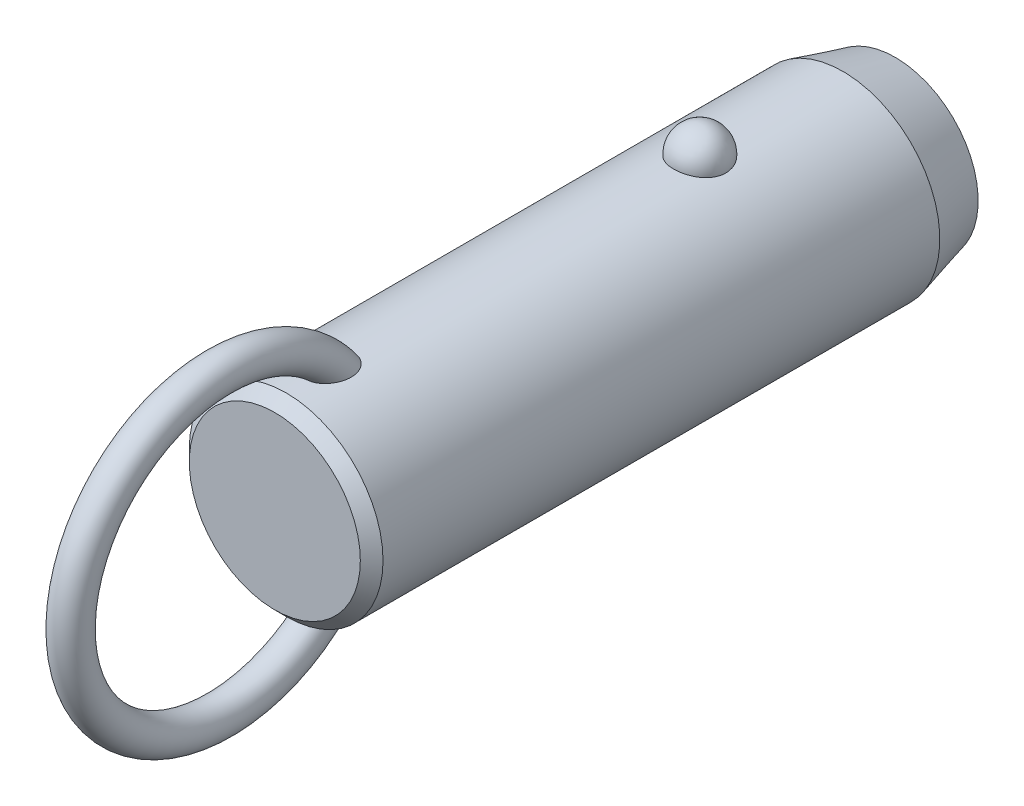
ISO-10303-21;
HEADER;
FILE_DESCRIPTION(('STEP AP214'),'2;1');
FILE_NAME('part.step','',(''),(''),'','','');
FILE_SCHEMA(('AUTOMOTIVE_DESIGN { 1 0 10303 214 1 1 1 1 }'));
ENDSEC;
DATA;
#1=APPLICATION_CONTEXT('core data for automotive mechanical design processes');
#2=APPLICATION_PROTOCOL_DEFINITION('international standard','automotive_design',2000,#1);
#3=PRODUCT_CONTEXT('',#1,'mechanical');
#4=PRODUCT('Part','Part','',(#3));
#5=PRODUCT_RELATED_PRODUCT_CATEGORY('part','',(#4));
#6=PRODUCT_DEFINITION_FORMATION('','',#4);
#7=PRODUCT_DEFINITION_CONTEXT('part definition',#1,'design');
#8=PRODUCT_DEFINITION('design','',#6,#7);
#9=PRODUCT_DEFINITION_SHAPE('','',#8);
#10=(LENGTH_UNIT() NAMED_UNIT(*) SI_UNIT(.MILLI.,.METRE.));
#11=(NAMED_UNIT(*) PLANE_ANGLE_UNIT() SI_UNIT($,.RADIAN.));
#12=(NAMED_UNIT(*) SI_UNIT($,.STERADIAN.) SOLID_ANGLE_UNIT());
#13=UNCERTAINTY_MEASURE_WITH_UNIT(LENGTH_MEASURE(1.E-05),#10,'distance_accuracy_value','');
#14=(GEOMETRIC_REPRESENTATION_CONTEXT(3) GLOBAL_UNCERTAINTY_ASSIGNED_CONTEXT((#13)) GLOBAL_UNIT_ASSIGNED_CONTEXT((#10,
#11,#12)) REPRESENTATION_CONTEXT('',''));
#15=CARTESIAN_POINT('',(0.,0.,0.));
#16=DIRECTION('',(0.,0.,1.));
#17=DIRECTION('',(1.,0.,0.));
#18=AXIS2_PLACEMENT_3D('',#15,#16,#17);
#19=CARTESIAN_POINT('',(0.,0.,33.));
#20=DIRECTION('',(0.,0.,-1.));
#21=DIRECTION('',(-1.,0.,0.));
#22=AXIS2_PLACEMENT_3D('',#19,#20,#21);
#23=CYLINDRICAL_SURFACE('',#22,11.1);
#24=CARTESIAN_POINT('',(2.9724815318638,10.6945945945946,-3.));
#25=CARTESIAN_POINT('',(2.9724783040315,10.6945972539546,-2.83225059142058));
#26=CARTESIAN_POINT('',(2.95876598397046,10.6984356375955,-2.66445972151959));
#27=CARTESIAN_POINT('',(2.90424529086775,10.7133624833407,-2.33362381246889));
#28=CARTESIAN_POINT('',(2.8634252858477,10.7244540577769,-2.1705808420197));
#29=CARTESIAN_POINT('',(2.75573657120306,10.7526272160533,-1.85396767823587));
#30=CARTESIAN_POINT('',(2.68887937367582,10.7697061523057,-1.70039333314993));
#31=CARTESIAN_POINT('',(2.53079696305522,10.8079438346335,-1.40691598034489));
#32=CARTESIAN_POINT('',(2.43957264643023,10.8291024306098,-1.2670124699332));
#33=CARTESIAN_POINT('',(2.23458150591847,10.8732541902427,-1.00409565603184));
#34=CARTESIAN_POINT('',(2.12071295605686,10.8962553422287,-0.881162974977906));
#35=CARTESIAN_POINT('',(1.87365402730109,10.9414421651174,-0.656352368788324));
#36=CARTESIAN_POINT('',(1.74046358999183,10.9636278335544,-0.554474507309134));
#37=CARTESIAN_POINT('',(1.45872188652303,11.0046495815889,-0.374872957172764));
#38=CARTESIAN_POINT('',(1.31021276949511,11.0234944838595,-0.29708522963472));
#39=CARTESIAN_POINT('',(1.00170030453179,11.0557957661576,-0.167529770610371));
#40=CARTESIAN_POINT('',(0.841698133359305,11.0692526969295,-0.115759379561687));
#41=CARTESIAN_POINT('',(0.51760779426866,11.0890932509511,-0.0403925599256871));
#42=CARTESIAN_POINT('',(0.353633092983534,11.0955916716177,-0.0163383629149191));
#43=CARTESIAN_POINT('',(0.0238420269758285,11.1011989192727,0.00445177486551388));
#44=CARTESIAN_POINT('',(-0.141974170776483,11.1003084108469,0.00119017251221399));
#45=CARTESIAN_POINT('',(-0.468405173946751,11.0912990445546,-0.0323233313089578));
#46=CARTESIAN_POINT('',(-0.629059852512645,11.0832767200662,-0.0622147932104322));
#47=CARTESIAN_POINT('',(-0.942937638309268,11.0609962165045,-0.147645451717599));
#48=CARTESIAN_POINT('',(-1.09616062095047,11.0467379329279,-0.203185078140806));
#49=CARTESIAN_POINT('',(-1.39181061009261,11.0134071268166,-0.338752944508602));
#50=CARTESIAN_POINT('',(-1.53417383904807,10.9943086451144,-0.418913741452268));
#51=CARTESIAN_POINT('',(-1.80342160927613,10.9533667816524,-0.601448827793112));
#52=CARTESIAN_POINT('',(-1.9303046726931,10.9315231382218,-0.70382523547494));
#53=CARTESIAN_POINT('',(-2.16747598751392,10.887005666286,-0.930091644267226));
#54=CARTESIAN_POINT('',(-2.27742774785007,10.8643239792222,-1.05433291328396));
#55=CARTESIAN_POINT('',(-2.47517316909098,10.8209886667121,-1.31966633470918));
#56=CARTESIAN_POINT('',(-2.56296538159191,10.8003351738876,-1.46075958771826));
#57=CARTESIAN_POINT('',(-2.71500300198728,10.7631304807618,-1.75753646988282));
#58=CARTESIAN_POINT('',(-2.77898901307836,10.7466250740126,-1.91335887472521));
#59=CARTESIAN_POINT('',(-2.88046189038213,10.7198747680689,-2.2339152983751));
#60=CARTESIAN_POINT('',(-2.91794947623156,10.709629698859,-2.39864907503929));
#61=CARTESIAN_POINT('',(-2.96537819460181,10.6965949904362,-2.73165170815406));
#62=CARTESIAN_POINT('',(-2.97542891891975,10.693775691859,-2.89990378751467));
#63=CARTESIAN_POINT('',(-2.96804271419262,10.6958279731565,-3.235752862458));
#64=CARTESIAN_POINT('',(-2.95060646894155,10.7006993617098,-3.40334987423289));
#65=CARTESIAN_POINT('',(-2.88883358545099,10.71753912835,-3.73233906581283));
#66=CARTESIAN_POINT('',(-2.84462026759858,10.7294749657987,-3.89375610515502));
#67=CARTESIAN_POINT('',(-2.73050447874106,10.7590797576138,-4.20667949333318));
#68=CARTESIAN_POINT('',(-2.66060103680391,10.7767489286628,-4.35818546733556));
#69=CARTESIAN_POINT('',(-2.49642559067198,10.8159599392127,-4.6478542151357));
#70=CARTESIAN_POINT('',(-2.40203047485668,10.8375211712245,-4.78594458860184));
#71=CARTESIAN_POINT('',(-2.19143488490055,10.8820570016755,-5.0441038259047));
#72=CARTESIAN_POINT('',(-2.07523364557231,10.9050316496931,-5.16417205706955));
#73=CARTESIAN_POINT('',(-1.82361254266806,10.9499219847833,-5.38334833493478));
#74=CARTESIAN_POINT('',(-1.68812945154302,10.9718338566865,-5.48238464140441));
#75=CARTESIAN_POINT('',(-1.40191298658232,11.0120611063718,-5.65618873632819));
#76=CARTESIAN_POINT('',(-1.25118062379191,11.0303767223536,-5.73095813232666));
#77=CARTESIAN_POINT('',(-0.940570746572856,11.0611653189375,-5.85334725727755));
#78=CARTESIAN_POINT('',(-0.780821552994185,11.0737044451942,-5.90127578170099));
#79=CARTESIAN_POINT('',(-0.455204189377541,11.0918598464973,-5.96992976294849));
#80=CARTESIAN_POINT('',(-0.289336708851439,11.0974768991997,-5.99065827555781));
#81=CARTESIAN_POINT('',(0.0406846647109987,11.1011307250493,-6.00418773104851));
#82=CARTESIAN_POINT('',(0.204817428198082,11.099299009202,-5.99747318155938));
#83=CARTESIAN_POINT('',(0.5295530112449,11.088551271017,-5.9574031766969));
#84=CARTESIAN_POINT('',(0.690155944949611,11.0796354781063,-5.92404858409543));
#85=CARTESIAN_POINT('',(1.0027760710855,11.0557204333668,-5.83180084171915));
#86=CARTESIAN_POINT('',(1.15482001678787,11.0407414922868,-5.77299291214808));
#87=CARTESIAN_POINT('',(1.44678373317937,11.0062913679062,-5.63147366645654));
#88=CARTESIAN_POINT('',(1.58670279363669,10.9868199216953,-5.54876095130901));
#89=CARTESIAN_POINT('',(1.8527023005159,10.9451315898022,-5.36027644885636));
#90=CARTESIAN_POINT('',(1.97855158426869,10.9228788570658,-5.25418644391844));
#91=CARTESIAN_POINT('',(2.21080872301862,10.8782509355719,-5.02251354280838));
#92=CARTESIAN_POINT('',(2.31721312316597,10.8558757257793,-4.89692718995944));
#93=CARTESIAN_POINT('',(2.50945517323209,10.8130715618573,-4.62745408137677));
#94=CARTESIAN_POINT('',(2.59493284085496,10.7926798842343,-4.48330448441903));
#95=CARTESIAN_POINT('',(2.740862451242,10.7565495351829,-4.18236358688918));
#96=CARTESIAN_POINT('',(2.80132490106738,10.7408089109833,-4.02557762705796));
#97=CARTESIAN_POINT('',(2.88959070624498,10.7173718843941,-3.72475308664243));
#98=CARTESIAN_POINT('',(2.92062102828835,10.7088950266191,-3.58171216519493));
#99=CARTESIAN_POINT('',(2.96206765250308,10.6975052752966,-3.29245795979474));
#100=CARTESIAN_POINT('',(2.97248434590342,10.6945922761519,-3.14624473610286));
#101=CARTESIAN_POINT('',(2.9724815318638,10.6945945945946,-3.));
#102=B_SPLINE_CURVE_WITH_KNOTS('',3,(#24,#25,#26,#27,#28,#29,#30,#31,#32,#33,#34,#35,#36,#37,
#38,#39,#40,#41,#42,#43,#44,#45,#46,#47,#48,#49,#50,#51,#52,#53,#54,#55,#56,#57,#58,#59,#60,#61,
#62,#63,#64,#65,#66,#67,#68,#69,#70,#71,#72,#73,#74,#75,#76,#77,#78,#79,#80,#81,#82,#83,#84,#85,
#86,#87,#88,#89,#90,#91,#92,#93,#94,#95,#96,#97,#98,#99,#100,#101),.UNSPECIFIED.,.T.,.F.,(4,2,2,
2,2,2,2,2,2,2,2,2,2,2,2,2,2,2,2,2,2,2,2,2,2,2,2,2,2,2,2,2,2,2,2,2,2,2,4),(0.,0.502722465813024,
1.00566079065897,1.5083769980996,2.01107471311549,2.51608392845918,3.02109467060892,
3.52475118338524,4.02835620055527,4.52351860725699,5.0186364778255,5.50715297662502,
5.99567766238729,6.48688002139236,6.97812923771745,7.47814366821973,7.97819077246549,
8.48353712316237,8.98886974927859,9.49218093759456,9.99547960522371,10.4964777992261,
10.997494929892,11.5010810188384,12.0046847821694,12.5099796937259,13.0152411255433,
13.5145635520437,14.0138298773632,14.5043200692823,14.9947943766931,15.4836390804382,
15.9725123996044,16.4685040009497,16.9645836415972,17.4686765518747,17.972557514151,
18.410841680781,18.849117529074),.UNSPECIFIED.);
#103=CARTESIAN_POINT('',(2.9724815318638,10.6945945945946,-3.));
#104=VERTEX_POINT('',#103);
#105=EDGE_CURVE('E41',#104,#104,#102,.T.);
#106=ORIENTED_EDGE('',*,*,#105,.T.);
#107=EDGE_LOOP('',(#106));
#108=FACE_BOUND('',#107,.T.);
#109=CARTESIAN_POINT('',(0.,0.,44.4));
#110=DIRECTION('',(0.,0.,1.));
#111=DIRECTION('',(1.,0.,0.));
#112=AXIS2_PLACEMENT_3D('',#109,#110,#111);
#113=CIRCLE('',#112,11.1);
#114=CARTESIAN_POINT('',(11.1,0.,44.4));
#115=VERTEX_POINT('',#114);
#116=EDGE_CURVE('E10',#115,#115,#113,.F.);
#117=ORIENTED_EDGE('',*,*,#116,.T.);
#118=EDGE_LOOP('',(#117));
#119=FACE_BOUND('',#118,.T.);
#120=CARTESIAN_POINT('',(-0.56452033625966,-11.0856356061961,36.6578154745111));
#121=CARTESIAN_POINT('',(-0.66720283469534,-11.0804062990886,36.6912839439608));
#122=CARTESIAN_POINT('',(-0.766875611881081,-11.0738877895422,36.7338357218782));
#123=CARTESIAN_POINT('',(-0.957284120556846,-11.0590576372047,36.8354190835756));
#124=CARTESIAN_POINT('',(-1.04801616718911,-11.0507452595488,36.8944574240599));
#125=CARTESIAN_POINT('',(-1.21800952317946,-11.0333016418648,37.0265293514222));
#126=CARTESIAN_POINT('',(-1.29730805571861,-11.0241732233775,37.0995156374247));
#127=CARTESIAN_POINT('',(-1.44337665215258,-11.0060026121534,37.2570374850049));
#128=CARTESIAN_POINT('',(-1.51014622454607,-10.9969604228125,37.3415734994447));
#129=CARTESIAN_POINT('',(-1.63454620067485,-10.9791841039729,37.5255213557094));
#130=CARTESIAN_POINT('',(-1.69127003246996,-10.9705107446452,37.6255493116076));
#131=CARTESIAN_POINT('',(-1.78980785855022,-10.9548648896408,37.8327902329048));
#132=CARTESIAN_POINT('',(-1.83161214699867,-10.9478935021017,37.9400078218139));
#133=CARTESIAN_POINT('',(-1.91557028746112,-10.9335803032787,38.2054080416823));
#134=CARTESIAN_POINT('',(-1.95040620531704,-10.9273269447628,38.3659806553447));
#135=CARTESIAN_POINT('',(-1.99388326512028,-10.9194709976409,38.6906977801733));
#136=CARTESIAN_POINT('',(-2.00248051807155,-10.9178762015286,38.8548478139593));
#137=CARTESIAN_POINT('',(-1.99551615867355,-10.9191578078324,39.2246504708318));
#138=CARTESIAN_POINT('',(-1.9732206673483,-10.9232807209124,39.4301911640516));
#139=CARTESIAN_POINT('',(-1.9152976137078,-10.9335244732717,39.733595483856));
#140=CARTESIAN_POINT('',(-1.89184575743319,-10.9376266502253,39.8340883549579));
#141=CARTESIAN_POINT('',(-1.83700674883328,-10.9469720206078,40.032855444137));
#142=CARTESIAN_POINT('',(-1.80562070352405,-10.9522150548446,40.1311299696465));
#143=CARTESIAN_POINT('',(-1.73463055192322,-10.9636837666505,40.3259148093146));
#144=CARTESIAN_POINT('',(-1.69493416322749,-10.9699202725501,40.4223907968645));
#145=CARTESIAN_POINT('',(-1.60745141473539,-10.9830806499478,40.6116262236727));
#146=CARTESIAN_POINT('',(-1.55966150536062,-10.9900048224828,40.7043840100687));
#147=CARTESIAN_POINT('',(-1.45591812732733,-11.0042280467,40.8846907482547));
#148=CARTESIAN_POINT('',(-1.40000013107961,-11.0115253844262,40.9722601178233));
#149=CARTESIAN_POINT('',(-1.2793747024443,-11.0261911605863,41.141029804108));
#150=CARTESIAN_POINT('',(-1.21467835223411,-11.0335594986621,41.2222379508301));
#151=CARTESIAN_POINT('',(-1.08218150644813,-11.0473027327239,41.3690010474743));
#152=CARTESIAN_POINT('',(-1.0152263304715,-11.0537063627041,41.4353092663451));
#153=CARTESIAN_POINT('',(-0.872952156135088,-11.065850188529,41.558378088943));
#154=CARTESIAN_POINT('',(-0.797642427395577,-11.0715911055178,41.6151491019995));
#155=CARTESIAN_POINT('',(-0.651396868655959,-11.081071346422,41.7075155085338));
#156=CARTESIAN_POINT('',(-0.581712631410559,-11.0849841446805,41.7450491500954));
#157=CARTESIAN_POINT('',(-0.4370660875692,-11.0916271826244,41.8082594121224));
#158=CARTESIAN_POINT('',(-0.362109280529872,-11.0943586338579,41.8339481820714));
#159=CARTESIAN_POINT('',(-0.207828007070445,-11.0983242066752,41.871117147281));
#160=CARTESIAN_POINT('',(-0.128467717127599,-11.0995432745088,41.8824545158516));
#161=CARTESIAN_POINT('',(0.0309101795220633,-11.1002423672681,41.8889658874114));
#162=CARTESIAN_POINT('',(0.110927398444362,-11.0997233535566,41.8841488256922));
#163=CARTESIAN_POINT('',(0.256406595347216,-11.097240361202,41.8609599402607));
#164=CARTESIAN_POINT('',(0.322235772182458,-11.0955074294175,41.8447543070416));
#165=CARTESIAN_POINT('',(0.450635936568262,-11.0910350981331,41.8026008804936));
#166=CARTESIAN_POINT('',(0.513205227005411,-11.0882951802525,41.7766480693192));
#167=CARTESIAN_POINT('',(0.66262634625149,-11.0805620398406,41.7026073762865));
#168=CARTESIAN_POINT('',(0.747127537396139,-11.0751144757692,41.6498452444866));
#169=CARTESIAN_POINT('',(0.906756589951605,-11.0631932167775,41.5317206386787));
#170=CARTESIAN_POINT('',(0.981859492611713,-11.0567168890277,41.4663257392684));
#171=CARTESIAN_POINT('',(1.1071220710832,-11.0447856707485,41.3422633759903));
#172=CARTESIAN_POINT('',(1.15909566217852,-11.0394280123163,41.2853831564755));
#173=CARTESIAN_POINT('',(1.25791923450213,-11.0286040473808,41.1673271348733));
#174=CARTESIAN_POINT('',(1.30476642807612,-11.0231376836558,41.1061490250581));
#175=CARTESIAN_POINT('',(1.43818612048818,-11.0068027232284,40.917305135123));
#176=CARTESIAN_POINT('',(1.51751767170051,-10.9960104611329,40.7844531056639));
#177=CARTESIAN_POINT('',(1.63597546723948,-10.9788847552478,40.5531371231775));
#178=CARTESIAN_POINT('',(1.67988876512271,-10.9722190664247,40.4570530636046));
#179=CARTESIAN_POINT('',(1.75953241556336,-10.9597298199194,40.2614311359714));
#180=CARTESIAN_POINT('',(1.79525967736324,-10.9539065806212,40.1618919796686));
#181=CARTESIAN_POINT('',(1.85844731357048,-10.9433632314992,39.9602111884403));
#182=CARTESIAN_POINT('',(1.88591073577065,-10.9386427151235,39.8580705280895));
#183=CARTESIAN_POINT('',(1.93234324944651,-10.9305350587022,39.651819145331));
#184=CARTESIAN_POINT('',(1.95131065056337,-10.9271481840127,39.5477080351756));
#185=CARTESIAN_POINT('',(1.99040203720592,-10.9201183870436,39.2654588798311));
#186=CARTESIAN_POINT('',(2.00221217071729,-10.9179256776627,39.0860370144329));
#187=CARTESIAN_POINT('',(1.99711676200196,-10.9188636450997,38.7277133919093));
#188=CARTESIAN_POINT('',(1.98026150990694,-10.9219849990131,38.5488112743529));
#189=CARTESIAN_POINT('',(1.92151657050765,-10.9324473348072,38.2364514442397));
#190=CARTESIAN_POINT('',(1.88605081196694,-10.9386915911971,38.1017594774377));
#191=CARTESIAN_POINT('',(1.79393020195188,-10.9541780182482,37.8399669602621));
#192=CARTESIAN_POINT('',(1.73729868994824,-10.9634168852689,37.7128582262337));
#193=CARTESIAN_POINT('',(1.61237037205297,-10.9824218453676,37.4894184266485));
#194=CARTESIAN_POINT('',(1.54715374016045,-10.9918945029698,37.3913455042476));
#195=CARTESIAN_POINT('',(1.40127026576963,-11.0114415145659,37.2074341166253));
#196=CARTESIAN_POINT('',(1.3206074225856,-11.0215157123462,37.1215924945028));
#197=CARTESIAN_POINT('',(1.1447478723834,-11.041168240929,36.9651630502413));
#198=CARTESIAN_POINT('',(1.0494780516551,-11.0507437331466,36.8946565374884));
#199=CARTESIAN_POINT('',(0.847278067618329,-11.0680789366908,36.772640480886));
#200=CARTESIAN_POINT('',(0.740351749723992,-11.0758392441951,36.7211246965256));
#201=CARTESIAN_POINT('',(0.52928931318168,-11.0878275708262,36.6434852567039));
#202=CARTESIAN_POINT('',(0.425895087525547,-11.0923259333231,36.615377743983));
#203=CARTESIAN_POINT('',(0.215723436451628,-11.0984001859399,36.5777038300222));
#204=CARTESIAN_POINT('',(0.108947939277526,-11.0999777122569,36.5681270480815));
#205=CARTESIAN_POINT('',(-0.0938962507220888,-11.1000196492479,36.5678773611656));
#206=CARTESIAN_POINT('',(-0.189967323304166,-11.0987797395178,36.5754089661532));
#207=CARTESIAN_POINT('',(-0.379657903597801,-11.0939111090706,36.6055079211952));
#208=CARTESIAN_POINT('',(-0.473277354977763,-11.0902823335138,36.6280756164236));
#209=CARTESIAN_POINT('',(-0.56452033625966,-11.0856356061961,36.6578154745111));
#210=B_SPLINE_CURVE_WITH_KNOTS('',3,(#120,#121,#122,#123,#124,#125,#126,#127,#128,#129,#130,
#131,#132,#133,#134,#135,#136,#137,#138,#139,#140,#141,#142,#143,#144,#145,#146,#147,#148,#149,
#150,#151,#152,#153,#154,#155,#156,#157,#158,#159,#160,#161,#162,#163,#164,#165,#166,#167,#168,
#169,#170,#171,#172,#173,#174,#175,#176,#177,#178,#179,#180,#181,#182,#183,#184,#185,#186,#187,
#188,#189,#190,#191,#192,#193,#194,#195,#196,#197,#198,#199,#200,#201,#202,#203,#204,#205,#206,
#207,#208,#209),.UNSPECIFIED.,.T.,.F.,(4,2,2,2,2,2,2,2,2,2,2,2,2,2,2,2,2,2,2,2,2,2,2,2,2,2,2,2,
2,2,2,2,2,2,2,2,2,2,2,2,2,2,2,2,4),(0.,0.323999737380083,0.648132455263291,0.971184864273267,
1.29424994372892,1.6388623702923,1.98369857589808,2.47426059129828,2.96564271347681,
3.5825739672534,3.89215258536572,4.20168803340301,4.51486273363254,4.82817514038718,
5.14015911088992,5.45175282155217,5.734428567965,6.01679375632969,6.25364580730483,
6.49025437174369,6.72919963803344,6.9680127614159,7.17061258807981,7.37331685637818,
7.67094989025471,7.96935728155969,8.20075067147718,8.43226927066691,8.8958162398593,
9.21306533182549,9.53043400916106,9.84768549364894,10.1650000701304,10.70229304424,
11.2386443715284,11.6553390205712,12.0715755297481,12.4245637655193,12.7774607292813,
13.1321855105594,13.4867936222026,13.8068771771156,14.1267813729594,14.4146787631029,
14.7025827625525),.UNSPECIFIED.);
#211=CARTESIAN_POINT('',(-0.56452033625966,-11.0856356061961,36.6578154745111));
#212=VERTEX_POINT('',#211);
#213=EDGE_CURVE('E59',#212,#212,#210,.T.);
#214=ORIENTED_EDGE('',*,*,#213,.T.);
#215=EDGE_LOOP('',(#214));
#216=FACE_BOUND('',#215,.T.);
#217=CARTESIAN_POINT('',(-0.56452033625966,11.0856356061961,36.6578154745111));
#218=CARTESIAN_POINT('',(-0.468542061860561,11.0905203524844,36.6265456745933));
#219=CARTESIAN_POINT('',(-0.369793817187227,11.0942886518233,36.6031576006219));
#220=CARTESIAN_POINT('',(-0.169555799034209,11.0991586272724,36.5730858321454));
#221=CARTESIAN_POINT('',(-0.0680604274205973,11.1002543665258,36.5664393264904));
#222=CARTESIAN_POINT('',(0.134549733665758,11.099646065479,36.5701579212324));
#223=CARTESIAN_POINT('',(0.235664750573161,11.0979441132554,36.5805103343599));
#224=CARTESIAN_POINT('',(0.434632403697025,11.0919342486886,36.6178318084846));
#225=CARTESIAN_POINT('',(0.532486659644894,11.0876276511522,36.6447924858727));
#226=CARTESIAN_POINT('',(0.722445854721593,11.0768742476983,36.7144096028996));
#227=CARTESIAN_POINT('',(0.814543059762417,11.0704246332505,36.7570866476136));
#228=CARTESIAN_POINT('',(0.990565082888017,11.0560659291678,36.8566487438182));
#229=CARTESIAN_POINT('',(1.07448844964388,11.048156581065,36.9135363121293));
#230=CARTESIAN_POINT('',(1.23562672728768,11.0313221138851,37.0422106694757));
#231=CARTESIAN_POINT('',(1.31242684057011,11.0223686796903,37.1145117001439));
#232=CARTESIAN_POINT('',(1.45398030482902,11.0045918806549,37.2700425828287));
#233=CARTESIAN_POINT('',(1.51873073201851,10.9957685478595,37.3532750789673));
#234=CARTESIAN_POINT('',(1.64107232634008,10.9782087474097,37.5363842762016));
#235=CARTESIAN_POINT('',(1.6974317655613,10.9695572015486,37.6370893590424));
#236=CARTESIAN_POINT('',(1.79515063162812,10.9539887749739,37.8456264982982));
#237=CARTESIAN_POINT('',(1.83649966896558,10.9470730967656,37.9534634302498));
#238=CARTESIAN_POINT('',(1.91931148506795,10.9329211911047,38.2203995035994));
#239=CARTESIAN_POINT('',(1.95340104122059,10.9267904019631,38.3818612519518));
#240=CARTESIAN_POINT('',(1.99526195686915,10.9192174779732,38.7082163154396));
#241=CARTESIAN_POINT('',(2.00298989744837,10.9177830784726,38.8731148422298));
#242=CARTESIAN_POINT('',(1.99396251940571,10.9194420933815,39.2441006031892));
#243=CARTESIAN_POINT('',(1.97050829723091,10.923774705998,39.4500387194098));
#244=CARTESIAN_POINT('',(1.91079643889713,10.9343131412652,39.7539019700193));
#245=CARTESIAN_POINT('',(1.8867370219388,10.9385106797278,39.8545296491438));
#246=CARTESIAN_POINT('',(1.83065508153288,10.9480376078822,40.0535107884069));
#247=CARTESIAN_POINT('',(1.79863369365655,10.9533668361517,40.151864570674));
#248=CARTESIAN_POINT('',(1.72633365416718,10.9649954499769,40.3467203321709));
#249=CARTESIAN_POINT('',(1.68596409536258,10.9713053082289,40.4431879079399));
#250=CARTESIAN_POINT('',(1.59707998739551,10.9845964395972,40.6323233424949));
#251=CARTESIAN_POINT('',(1.54856169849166,10.9915780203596,40.7249894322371));
#252=CARTESIAN_POINT('',(1.4433016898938,11.0058935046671,40.9049752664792));
#253=CARTESIAN_POINT('',(1.38659749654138,11.0132257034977,40.992316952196));
#254=CARTESIAN_POINT('',(1.26431158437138,11.0279330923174,41.1604563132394));
#255=CARTESIAN_POINT('',(1.198741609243,11.0353082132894,41.2412624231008));
#256=CARTESIAN_POINT('',(1.06542088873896,11.048931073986,41.3859856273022));
#257=CARTESIAN_POINT('',(0.998640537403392,11.0552153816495,41.450784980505));
#258=CARTESIAN_POINT('',(0.856896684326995,11.0671032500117,41.5708462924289));
#259=CARTESIAN_POINT('',(0.781942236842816,11.0727075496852,41.6261186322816));
#260=CARTESIAN_POINT('',(0.636276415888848,11.081949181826,41.7159721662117));
#261=CARTESIAN_POINT('',(0.566755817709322,11.0857572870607,41.7524410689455));
#262=CARTESIAN_POINT('',(0.422602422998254,11.0921860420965,41.8135333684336));
#263=CARTESIAN_POINT('',(0.347974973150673,11.0948079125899,41.8381689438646));
#264=CARTESIAN_POINT('',(0.194593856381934,11.0985608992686,41.8733233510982));
#265=CARTESIAN_POINT('',(0.11580793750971,11.0996777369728,41.8837069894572));
#266=CARTESIAN_POINT('',(-0.0422499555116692,11.1002003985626,41.8885747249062));
#267=CARTESIAN_POINT('',(-0.121521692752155,11.09960699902,41.883066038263));
#268=CARTESIAN_POINT('',(-0.266046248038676,11.0970123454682,41.8588271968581));
#269=CARTESIAN_POINT('',(-0.331661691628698,11.0952283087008,41.8421356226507));
#270=CARTESIAN_POINT('',(-0.459588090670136,11.0906663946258,41.7991117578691));
#271=CARTESIAN_POINT('',(-0.521897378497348,11.0878880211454,41.772774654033));
#272=CARTESIAN_POINT('',(-0.671446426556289,11.0800342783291,41.6975130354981));
#273=CARTESIAN_POINT('',(-0.756250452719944,11.0744969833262,41.643818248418));
#274=CARTESIAN_POINT('',(-0.916349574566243,11.0624045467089,41.5238029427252));
#275=CARTESIAN_POINT('',(-0.991618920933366,11.0558467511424,41.4574493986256));
#276=CARTESIAN_POINT('',(-1.11713140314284,11.0437783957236,41.3316335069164));
#277=CARTESIAN_POINT('',(-1.16920539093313,11.0383619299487,41.2739524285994));
#278=CARTESIAN_POINT('',(-1.26817476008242,11.02743010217,41.1542809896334));
#279=CARTESIAN_POINT('',(-1.315067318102,11.0219146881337,41.0922883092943));
#280=CARTESIAN_POINT('',(-1.40399813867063,11.0109399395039,40.9647843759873));
#281=CARTESIAN_POINT('',(-1.4460286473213,11.0054807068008,40.8992677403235));
#282=CARTESIAN_POINT('',(-1.52538779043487,10.9947621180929,40.7654223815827));
#283=CARTESIAN_POINT('',(-1.56271516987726,10.9895028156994,40.6970929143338));
#284=CARTESIAN_POINT('',(-1.64537943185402,10.9774790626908,40.5332101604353));
#285=CARTESIAN_POINT('',(-1.68879497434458,10.9708503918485,40.4366735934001));
#286=CARTESIAN_POINT('',(-1.76740738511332,10.9584602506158,40.2402369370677));
#287=CARTESIAN_POINT('',(-1.80260120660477,10.95269910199,40.1403356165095));
#288=CARTESIAN_POINT('',(-1.86468657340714,10.9423003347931,39.9379663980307));
#289=CARTESIAN_POINT('',(-1.8915816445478,10.9376622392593,39.8354996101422));
#290=CARTESIAN_POINT('',(-1.93682458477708,10.9297405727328,39.6286429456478));
#291=CARTESIAN_POINT('',(-1.95517082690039,10.9264572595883,39.5242527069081));
#292=CARTESIAN_POINT('',(-1.99232562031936,10.9197647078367,39.2426287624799));
#293=CARTESIAN_POINT('',(-2.00294603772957,10.9177914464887,39.0641857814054));
#294=CARTESIAN_POINT('',(-1.99566675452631,10.9191290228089,38.7079962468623));
#295=CARTESIAN_POINT('',(-1.97781651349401,10.9224306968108,38.5302490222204));
#296=CARTESIAN_POINT('',(-1.91747214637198,10.9331592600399,38.2197921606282));
#297=CARTESIAN_POINT('',(-1.88131022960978,10.9395108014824,38.085825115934));
#298=CARTESIAN_POINT('',(-1.78790380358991,10.9551659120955,37.8255975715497));
#299=CARTESIAN_POINT('',(-1.73068309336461,10.9644661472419,37.6993285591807));
#300=CARTESIAN_POINT('',(-1.60475573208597,10.9835398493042,37.4774156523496));
#301=CARTESIAN_POINT('',(-1.53908879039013,10.9930297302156,37.3800265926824));
#302=CARTESIAN_POINT('',(-1.39238608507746,11.0125708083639,37.1975250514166));
#303=CARTESIAN_POINT('',(-1.31135150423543,11.0226219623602,37.1124116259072));
#304=CARTESIAN_POINT('',(-1.14382035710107,11.0411991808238,36.9652994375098));
#305=CARTESIAN_POINT('',(-1.05858500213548,11.0497792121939,36.9018693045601));
#306=CARTESIAN_POINT('',(-0.878723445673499,11.0655285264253,36.7902505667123));
#307=CARTESIAN_POINT('',(-0.784123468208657,11.0727015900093,36.7420208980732));
#308=CARTESIAN_POINT('',(-0.646163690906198,11.0812501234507,36.686023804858));
#309=CARTESIAN_POINT('',(-0.605595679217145,11.0835451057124,36.6711978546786));
#310=CARTESIAN_POINT('',(-0.56452033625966,11.0856356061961,36.6578154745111));
#311=B_SPLINE_CURVE_WITH_KNOTS('',3,(#217,#218,#219,#220,#221,#222,#223,#224,#225,#226,#227,
#228,#229,#230,#231,#232,#233,#234,#235,#236,#237,#238,#239,#240,#241,#242,#243,#244,#245,#246,
#247,#248,#249,#250,#251,#252,#253,#254,#255,#256,#257,#258,#259,#260,#261,#262,#263,#264,#265,
#266,#267,#268,#269,#270,#271,#272,#273,#274,#275,#276,#277,#278,#279,#280,#281,#282,#283,#284,
#285,#286,#287,#288,#289,#290,#291,#292,#293,#294,#295,#296,#297,#298,#299,#300,#301,#302,#303,
#304,#305,#306,#307,#308,#309,#310),.UNSPECIFIED.,.T.,.F.,(4,2,2,2,2,2,2,2,2,2,2,2,2,2,2,2,2,2,
2,2,2,2,2,2,2,2,2,2,2,2,2,2,2,2,2,2,2,2,2,2,2,2,2,2,2,2,4),(0.,0.303061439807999,
0.60679549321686,0.910302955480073,1.21365733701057,1.51741085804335,1.82121821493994,
2.13745205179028,2.45376252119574,2.799586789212,3.14564996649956,3.63832391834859,
4.13180893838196,4.75031912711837,5.06071926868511,5.37107516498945,5.68500772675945,
5.99908475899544,6.3117651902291,6.62403542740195,6.90315673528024,7.18197194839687,
7.41687778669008,7.6515413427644,7.8884158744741,8.12518286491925,8.32752842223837,
8.52997509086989,8.82986421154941,9.13054668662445,9.36393502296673,9.59744991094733,
9.83133221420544,10.0652767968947,10.383032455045,10.7009056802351,11.0186436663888,
11.3364420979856,11.8705925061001,12.4038159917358,12.8189662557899,13.2336487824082,
13.5857049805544,13.9377340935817,14.2561354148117,14.5736690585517,14.7033687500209),.UNSPECIFIED.);
#312=CARTESIAN_POINT('',(-0.56452033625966,11.0856356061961,36.6578154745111));
#313=VERTEX_POINT('',#312);
#314=EDGE_CURVE('E67',#313,#313,#311,.T.);
#315=ORIENTED_EDGE('',*,*,#314,.T.);
#316=EDGE_LOOP('',(#315));
#317=FACE_BOUND('',#316,.T.);
#318=CARTESIAN_POINT('',(0.,0.,-19.3999999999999));
#319=DIRECTION('',(0.,0.,-1.));
#320=DIRECTION('',(-1.,0.,0.));
#321=AXIS2_PLACEMENT_3D('',#318,#319,#320);
#322=CIRCLE('',#321,11.1);
#323=CARTESIAN_POINT('',(-11.1,0.,-19.3999999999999));
#324=VERTEX_POINT('',#323);
#325=EDGE_CURVE('E56',#324,#324,#322,.F.);
#326=ORIENTED_EDGE('',*,*,#325,.T.);
#327=EDGE_LOOP('',(#326));
#328=FACE_BOUND('',#327,.T.);
#329=ADVANCED_FACE('F37',(#108,#119,#216,#317,#328),#23,.T.);
#330=CARTESIAN_POINT('',(0.,0.,-25.4));
#331=DIRECTION('',(0.,0.,-1.));
#332=DIRECTION('',(-1.,0.,0.));
#333=AXIS2_PLACEMENT_3D('',#330,#331,#332);
#334=PLANE('',#333);
#335=CARTESIAN_POINT('',(0.,0.,-25.4));
#336=DIRECTION('',(0.,0.,-1.));
#337=DIRECTION('',(-1.,0.,0.));
#338=AXIS2_PLACEMENT_3D('',#335,#336,#337);
#339=CIRCLE('',#338,9.49230484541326);
#340=CARTESIAN_POINT('',(-9.49230484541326,0.,-25.4));
#341=VERTEX_POINT('',#340);
#342=EDGE_CURVE('E66',#341,#341,#339,.T.);
#343=ORIENTED_EDGE('',*,*,#342,.T.);
#344=EDGE_LOOP('',(#343));
#345=FACE_BOUND('',#344,.T.);
#346=ADVANCED_FACE('F85',(#345),#334,.T.);
#347=CARTESIAN_POINT('',(0.,0.,-25.4));
#348=DIRECTION('',(0.,0.,1.));
#349=DIRECTION('',(1.,0.,0.));
#350=AXIS2_PLACEMENT_3D('',#347,#348,#349);
#351=CONICAL_SURFACE('',#350,9.49230484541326,0.261799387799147);
#352=ORIENTED_EDGE('',*,*,#325,.F.);
#353=EDGE_LOOP('',(#352));
#354=FACE_BOUND('',#353,.T.);
#355=ORIENTED_EDGE('',*,*,#342,.F.);
#356=EDGE_LOOP('',(#355));
#357=FACE_BOUND('',#356,.T.);
#358=ADVANCED_FACE('F83',(#354,#357),#351,.T.);
#359=CARTESIAN_POINT('',(0.,0.,45.7));
#360=DIRECTION('',(0.,0.,1.));
#361=DIRECTION('',(1.,0.,0.));
#362=AXIS2_PLACEMENT_3D('',#359,#360,#361);
#363=PLANE('',#362);
#364=CARTESIAN_POINT('',(0.,0.,45.7));
#365=DIRECTION('',(0.,0.,1.));
#366=DIRECTION('',(1.,0.,0.));
#367=AXIS2_PLACEMENT_3D('',#364,#365,#366);
#368=CIRCLE('',#367,9.79999999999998);
#369=CARTESIAN_POINT('',(9.79999999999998,0.,45.7));
#370=VERTEX_POINT('',#369);
#371=EDGE_CURVE('E50',#370,#370,#368,.T.);
#372=ORIENTED_EDGE('',*,*,#371,.T.);
#373=EDGE_LOOP('',(#372));
#374=FACE_BOUND('',#373,.T.);
#375=ADVANCED_FACE('F77',(#374),#363,.T.);
#376=CARTESIAN_POINT('',(0.,0.,52.05));
#377=DIRECTION('',(1.,0.,0.));
#378=DIRECTION('',(0.,0.,-1.));
#379=AXIS2_PLACEMENT_3D('',#376,#377,#378);
#380=TOROIDAL_SURFACE('',#379,17.05,2.);
#381=ORIENTED_EDGE('',*,*,#314,.F.);
#382=EDGE_LOOP('',(#381));
#383=FACE_BOUND('',#382,.T.);
#384=ORIENTED_EDGE('',*,*,#213,.F.);
#385=EDGE_LOOP('',(#384));
#386=FACE_BOUND('',#385,.T.);
#387=ADVANCED_FACE('F73',(#383,#386),#380,.T.);
#388=CARTESIAN_POINT('',(0.,0.,45.7));
#389=DIRECTION('',(0.,0.,-1.));
#390=DIRECTION('',(-1.,0.,0.));
#391=AXIS2_PLACEMENT_3D('',#388,#389,#390);
#392=CONICAL_SURFACE('',#391,9.79999999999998,0.785398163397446);
#393=ORIENTED_EDGE('',*,*,#116,.F.);
#394=EDGE_LOOP('',(#393));
#395=FACE_BOUND('',#394,.T.);
#396=ORIENTED_EDGE('',*,*,#371,.F.);
#397=EDGE_LOOP('',(#396));
#398=FACE_BOUND('',#397,.T.);
#399=ADVANCED_FACE('F39',(#395,#398),#392,.T.);
#400=CARTESIAN_POINT('',(0.,11.1,-3.));
#401=DIRECTION('',(0.,1.,0.));
#402=DIRECTION('',(0.,0.,-1.));
#403=AXIS2_PLACEMENT_3D('',#400,#401,#402);
#404=SPHERICAL_SURFACE('',#403,3.);
#405=ORIENTED_EDGE('',*,*,#105,.F.);
#406=EDGE_LOOP('',(#405));
#407=FACE_BOUND('',#406,.T.);
#408=ADVANCED_FACE('F79',(#407),#404,.T.);
#409=CLOSED_SHELL('',(#329,#346,#358,#375,#387,#399,#408));
#410=MANIFOLD_SOLID_BREP('B2',#409);
#411=ADVANCED_BREP_SHAPE_REPRESENTATION('',(#18,#410),#14);
#412=SHAPE_DEFINITION_REPRESENTATION(#9,#411);
ENDSEC;
END-ISO-10303-21;
